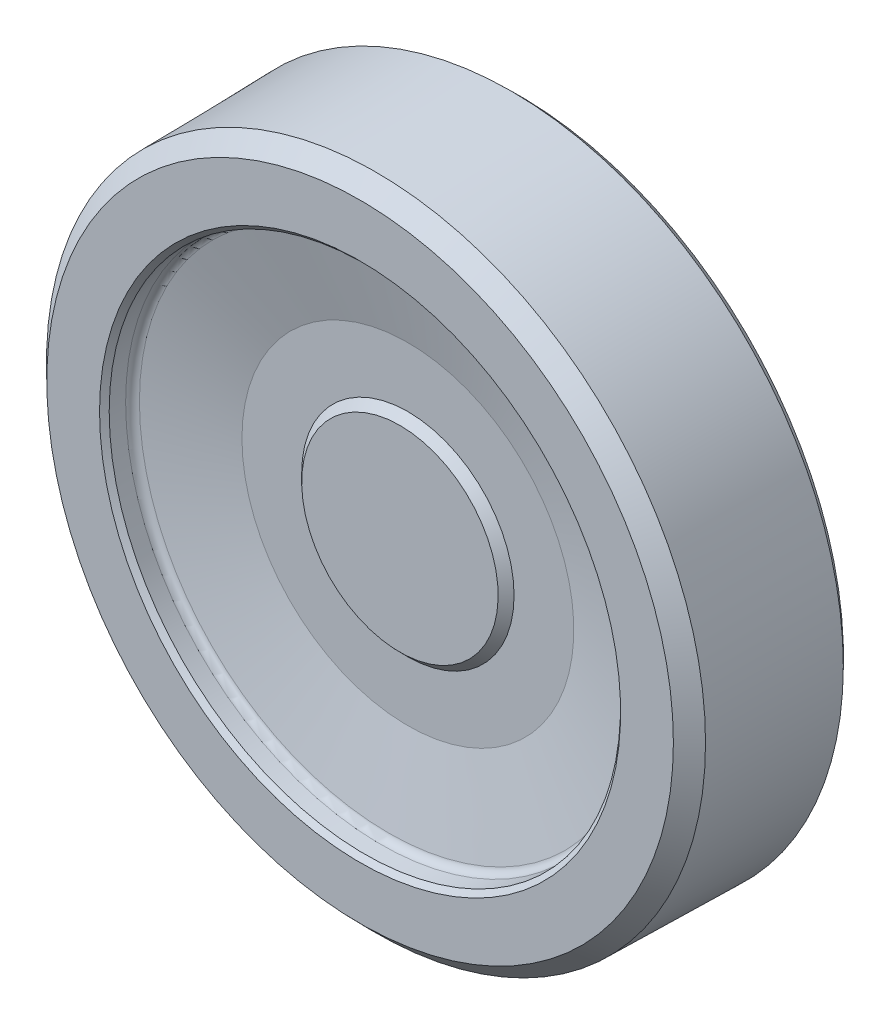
ISO-10303-21;
HEADER;
FILE_DESCRIPTION(('STEP AP214'),'2;1');
FILE_NAME('part.step','',(''),(''),'','','');
FILE_SCHEMA(('AUTOMOTIVE_DESIGN { 1 0 10303 214 1 1 1 1 }'));
ENDSEC;
DATA;
#1=APPLICATION_CONTEXT('core data for automotive mechanical design processes');
#2=APPLICATION_PROTOCOL_DEFINITION('international standard','automotive_design',2000,#1);
#3=PRODUCT_CONTEXT('',#1,'mechanical');
#4=PRODUCT('Part','Part','',(#3));
#5=PRODUCT_RELATED_PRODUCT_CATEGORY('part','',(#4));
#6=PRODUCT_DEFINITION_FORMATION('','',#4);
#7=PRODUCT_DEFINITION_CONTEXT('part definition',#1,'design');
#8=PRODUCT_DEFINITION('design','',#6,#7);
#9=PRODUCT_DEFINITION_SHAPE('','',#8);
#10=(LENGTH_UNIT() NAMED_UNIT(*) SI_UNIT(.MILLI.,.METRE.));
#11=(NAMED_UNIT(*) PLANE_ANGLE_UNIT() SI_UNIT($,.RADIAN.));
#12=(NAMED_UNIT(*) SI_UNIT($,.STERADIAN.) SOLID_ANGLE_UNIT());
#13=UNCERTAINTY_MEASURE_WITH_UNIT(LENGTH_MEASURE(1.E-05),#10,'distance_accuracy_value','');
#14=(GEOMETRIC_REPRESENTATION_CONTEXT(3) GLOBAL_UNCERTAINTY_ASSIGNED_CONTEXT((#13)) GLOBAL_UNIT_ASSIGNED_CONTEXT((#10,
#11,#12)) REPRESENTATION_CONTEXT('',''));
#15=CARTESIAN_POINT('',(0.,0.,0.));
#16=DIRECTION('',(0.,0.,1.));
#17=DIRECTION('',(1.,0.,0.));
#18=AXIS2_PLACEMENT_3D('',#15,#16,#17);
#19=CARTESIAN_POINT('',(7.55,0.,0.));
#20=DIRECTION('',(0.,0.,1.));
#21=DIRECTION('',(-1.,0.,0.));
#22=AXIS2_PLACEMENT_3D('',#19,#20,#21);
#23=PLANE('',#22);
#24=CARTESIAN_POINT('',(0.,0.,0.));
#25=DIRECTION('',(0.,0.,1.));
#26=DIRECTION('',(-1.,0.,0.));
#27=AXIS2_PLACEMENT_3D('',#24,#25,#26);
#28=CIRCLE('',#27,7.55);
#29=CARTESIAN_POINT('',(-7.55,0.,0.));
#30=VERTEX_POINT('',#29);
#31=EDGE_CURVE('E15',#30,#30,#28,.T.);
#32=ORIENTED_EDGE('',*,*,#31,.F.);
#33=EDGE_LOOP('',(#32));
#34=FACE_BOUND('',#33,.T.);
#35=ADVANCED_FACE('F12',(#34),#23,.F.);
#36=CARTESIAN_POINT('',(0.,0.,0.45));
#37=DIRECTION('',(0.,0.,1.));
#38=DIRECTION('',(-1.,0.,0.));
#39=AXIS2_PLACEMENT_3D('',#36,#37,#38);
#40=CONICAL_SURFACE('',#39,8.,0.785398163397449);
#41=CARTESIAN_POINT('',(0.,0.,0.45));
#42=DIRECTION('',(0.,0.,1.));
#43=DIRECTION('',(-1.,0.,0.));
#44=AXIS2_PLACEMENT_3D('',#41,#42,#43);
#45=CIRCLE('',#44,8.);
#46=CARTESIAN_POINT('',(-8.,0.,0.45));
#47=VERTEX_POINT('',#46);
#48=EDGE_CURVE('E186',#47,#47,#45,.T.);
#49=ORIENTED_EDGE('',*,*,#48,.F.);
#50=EDGE_LOOP('',(#49));
#51=FACE_BOUND('',#50,.T.);
#52=ORIENTED_EDGE('',*,*,#31,.T.);
#53=EDGE_LOOP('',(#52));
#54=FACE_BOUND('',#53,.T.);
#55=ADVANCED_FACE('F112',(#51,#54),#40,.T.);
#56=CARTESIAN_POINT('',(0.,0.,0.));
#57=DIRECTION('',(0.,0.,1.));
#58=DIRECTION('',(-1.,0.,0.));
#59=AXIS2_PLACEMENT_3D('',#56,#57,#58);
#60=CYLINDRICAL_SURFACE('',#59,8.);
#61=CARTESIAN_POINT('',(0.,0.,9.));
#62=DIRECTION('',(0.,0.,1.));
#63=DIRECTION('',(-1.,0.,0.));
#64=AXIS2_PLACEMENT_3D('',#61,#62,#63);
#65=CIRCLE('',#64,8.);
#66=CARTESIAN_POINT('',(-8.,0.,9.));
#67=VERTEX_POINT('',#66);
#68=EDGE_CURVE('E184',#67,#67,#65,.F.);
#69=ORIENTED_EDGE('',*,*,#68,.T.);
#70=EDGE_LOOP('',(#69));
#71=FACE_BOUND('',#70,.T.);
#72=ORIENTED_EDGE('',*,*,#48,.T.);
#73=EDGE_LOOP('',(#72));
#74=FACE_BOUND('',#73,.T.);
#75=ADVANCED_FACE('F109',(#71,#74),#60,.T.);
#76=CARTESIAN_POINT('',(0.,0.,19.));
#77=DIRECTION('',(0.,0.,-1.));
#78=DIRECTION('',(1.,0.,0.));
#79=AXIS2_PLACEMENT_3D('',#76,#77,#78);
#80=PLANE('',#79);
#81=CARTESIAN_POINT('',(0.,0.,19.));
#82=DIRECTION('',(0.,0.,-1.));
#83=DIRECTION('',(0.,1.,0.));
#84=AXIS2_PLACEMENT_3D('',#81,#82,#83);
#85=CIRCLE('',#84,7.4);
#86=CARTESIAN_POINT('',(0.,7.4,19.));
#87=VERTEX_POINT('',#86);
#88=EDGE_CURVE('E179',#87,#87,#85,.T.);
#89=ORIENTED_EDGE('',*,*,#88,.F.);
#90=EDGE_LOOP('',(#89));
#91=FACE_BOUND('',#90,.T.);
#92=ADVANCED_FACE('F105',(#91),#80,.F.);
#93=CARTESIAN_POINT('',(13.,0.,9.));
#94=DIRECTION('',(0.,0.,1.));
#95=DIRECTION('',(-1.,0.,0.));
#96=AXIS2_PLACEMENT_3D('',#93,#94,#95);
#97=PLANE('',#96);
#98=CARTESIAN_POINT('',(0.,0.,9.));
#99=DIRECTION('',(0.,0.,1.));
#100=DIRECTION('',(-1.,0.,0.));
#101=AXIS2_PLACEMENT_3D('',#98,#99,#100);
#102=CIRCLE('',#101,13.);
#103=CARTESIAN_POINT('',(-13.,0.,9.));
#104=VERTEX_POINT('',#103);
#105=EDGE_CURVE('E174',#104,#104,#102,.F.);
#106=ORIENTED_EDGE('',*,*,#105,.T.);
#107=EDGE_LOOP('',(#106));
#108=FACE_BOUND('',#107,.T.);
#109=ORIENTED_EDGE('',*,*,#68,.F.);
#110=EDGE_LOOP('',(#109));
#111=FACE_BOUND('',#110,.T.);
#112=ADVANCED_FACE('F101',(#108,#111),#97,.F.);
#113=CARTESIAN_POINT('',(0.,0.,18.4));
#114=DIRECTION('',(0.,0.,-1.));
#115=DIRECTION('',(0.,1.,0.));
#116=AXIS2_PLACEMENT_3D('',#113,#114,#115);
#117=CONICAL_SURFACE('',#116,8.,0.78539816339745);
#118=ORIENTED_EDGE('',*,*,#88,.T.);
#119=EDGE_LOOP('',(#118));
#120=FACE_BOUND('',#119,.T.);
#121=CARTESIAN_POINT('',(0.,0.,18.4));
#122=DIRECTION('',(0.,0.,-1.));
#123=DIRECTION('',(0.,1.,0.));
#124=AXIS2_PLACEMENT_3D('',#121,#122,#123);
#125=CIRCLE('',#124,8.);
#126=CARTESIAN_POINT('',(0.,8.,18.4));
#127=VERTEX_POINT('',#126);
#128=EDGE_CURVE('E170',#127,#127,#125,.F.);
#129=ORIENTED_EDGE('',*,*,#128,.T.);
#130=EDGE_LOOP('',(#129));
#131=FACE_BOUND('',#130,.T.);
#132=ADVANCED_FACE('F97',(#120,#131),#117,.T.);
#133=CARTESIAN_POINT('',(0.,0.,0.));
#134=DIRECTION('',(0.,0.,1.));
#135=DIRECTION('',(-1.,0.,0.));
#136=AXIS2_PLACEMENT_3D('',#133,#134,#135);
#137=CYLINDRICAL_SURFACE('',#136,13.);
#138=CARTESIAN_POINT('',(0.,0.,8.97526975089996));
#139=DIRECTION('',(0.,0.,-1.));
#140=DIRECTION('',(1.,0.,0.));
#141=AXIS2_PLACEMENT_3D('',#138,#139,#140);
#142=CIRCLE('',#141,13.);
#143=CARTESIAN_POINT('',(13.,0.,8.97526975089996));
#144=VERTEX_POINT('',#143);
#145=EDGE_CURVE('E82',#144,#144,#142,.T.);
#146=ORIENTED_EDGE('',*,*,#145,.T.);
#147=EDGE_LOOP('',(#146));
#148=FACE_BOUND('',#147,.T.);
#149=ORIENTED_EDGE('',*,*,#105,.F.);
#150=EDGE_LOOP('',(#149));
#151=FACE_BOUND('',#150,.T.);
#152=ADVANCED_FACE('F93',(#148,#151),#137,.F.);
#153=CARTESIAN_POINT('',(8.,0.,18.4));
#154=DIRECTION('',(0.,0.,-1.));
#155=DIRECTION('',(1.,0.,0.));
#156=AXIS2_PLACEMENT_3D('',#153,#154,#155);
#157=PLANE('',#156);
#158=ORIENTED_EDGE('',*,*,#128,.F.);
#159=EDGE_LOOP('',(#158));
#160=FACE_BOUND('',#159,.T.);
#161=CARTESIAN_POINT('',(0.,0.,18.4));
#162=DIRECTION('',(0.,0.,1.));
#163=DIRECTION('',(-1.,0.,0.));
#164=AXIS2_PLACEMENT_3D('',#161,#162,#163);
#165=CIRCLE('',#164,12.5);
#166=CARTESIAN_POINT('',(-12.5,0.,18.4));
#167=VERTEX_POINT('',#166);
#168=EDGE_CURVE('E77',#167,#167,#165,.T.);
#169=ORIENTED_EDGE('',*,*,#168,.T.);
#170=EDGE_LOOP('',(#169));
#171=FACE_BOUND('',#170,.T.);
#172=ADVANCED_FACE('F89',(#160,#171),#157,.F.);
#173=CARTESIAN_POINT('',(0.,0.,8.97526975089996));
#174=DIRECTION('',(0.,0.,-1.));
#175=DIRECTION('',(1.,0.,0.));
#176=AXIS2_PLACEMENT_3D('',#173,#174,#175);
#177=TOROIDAL_SURFACE('',#176,14.2,1.2);
#178=CARTESIAN_POINT('',(0.,0.,10.102900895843));
#179=DIRECTION('',(0.,0.,1.));
#180=DIRECTION('',(-1.,0.,0.));
#181=AXIS2_PLACEMENT_3D('',#178,#179,#180);
#182=CIRCLE('',#181,13.7895758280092);
#183=CARTESIAN_POINT('',(-13.7895758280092,0.,10.102900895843));
#184=VERTEX_POINT('',#183);
#185=EDGE_CURVE('E72',#184,#184,#182,.T.);
#186=ORIENTED_EDGE('',*,*,#185,.F.);
#187=EDGE_LOOP('',(#186));
#188=FACE_BOUND('',#187,.T.);
#189=ORIENTED_EDGE('',*,*,#145,.F.);
#190=EDGE_LOOP('',(#189));
#191=FACE_BOUND('',#190,.T.);
#192=ADVANCED_FACE('F85',(#188,#191),#177,.F.);
#193=CARTESIAN_POINT('',(0.,0.,19.8484699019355));
#194=DIRECTION('',(0.,0.,1.));
#195=DIRECTION('',(-1.,0.,0.));
#196=AXIS2_PLACEMENT_3D('',#193,#194,#195);
#197=CONICAL_SURFACE('',#196,18.7740124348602,1.34390352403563);
#198=ORIENTED_EDGE('',*,*,#168,.F.);
#199=EDGE_LOOP('',(#198));
#200=FACE_BOUND('',#199,.T.);
#201=CARTESIAN_POINT('',(0.,0.,19.8484699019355));
#202=DIRECTION('',(0.,0.,-1.));
#203=DIRECTION('',(1.,0.,0.));
#204=AXIS2_PLACEMENT_3D('',#201,#202,#203);
#205=CIRCLE('',#204,18.7740124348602);
#206=CARTESIAN_POINT('',(18.7740124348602,0.,19.8484699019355));
#207=VERTEX_POINT('',#206);
#208=EDGE_CURVE('E69',#207,#207,#205,.F.);
#209=ORIENTED_EDGE('',*,*,#208,.T.);
#210=EDGE_LOOP('',(#209));
#211=FACE_BOUND('',#210,.T.);
#212=ADVANCED_FACE('F88',(#200,#211),#197,.F.);
#213=CARTESIAN_POINT('',(0.,0.,11.7902601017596));
#214=DIRECTION('',(0.,0.,1.));
#215=DIRECTION('',(-1.,0.,0.));
#216=AXIS2_PLACEMENT_3D('',#213,#214,#215);
#217=CONICAL_SURFACE('',#216,18.4255571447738,1.22173047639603);
#218=CARTESIAN_POINT('',(0.,0.,11.7902601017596));
#219=DIRECTION('',(0.,0.,-1.));
#220=DIRECTION('',(1.,0.,0.));
#221=AXIS2_PLACEMENT_3D('',#218,#219,#220);
#222=CIRCLE('',#221,18.4255571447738);
#223=CARTESIAN_POINT('',(18.4255571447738,0.,11.7902601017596));
#224=VERTEX_POINT('',#223);
#225=EDGE_CURVE('E45',#224,#224,#222,.T.);
#226=ORIENTED_EDGE('',*,*,#225,.T.);
#227=EDGE_LOOP('',(#226));
#228=FACE_BOUND('',#227,.T.);
#229=ORIENTED_EDGE('',*,*,#185,.T.);
#230=EDGE_LOOP('',(#229));
#231=FACE_BOUND('',#230,.T.);
#232=ADVANCED_FACE('F63',(#228,#231),#217,.T.);
#233=CARTESIAN_POINT('',(0.,0.,20.4330919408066));
#234=DIRECTION('',(0.,0.,-1.));
#235=DIRECTION('',(1.,0.,0.));
#236=AXIS2_PLACEMENT_3D('',#233,#234,#235);
#237=TOROIDAL_SURFACE('',#236,18.6390418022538,0.6);
#238=ORIENTED_EDGE('',*,*,#208,.F.);
#239=EDGE_LOOP('',(#238));
#240=FACE_BOUND('',#239,.T.);
#241=CARTESIAN_POINT('',(0.,0.,20.4226204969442));
#242=DIRECTION('',(0.,0.,1.));
#243=DIRECTION('',(-1.,0.,0.));
#244=AXIS2_PLACEMENT_3D('',#241,#242,#243);
#245=CIRCLE('',#244,19.2389504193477);
#246=CARTESIAN_POINT('',(-19.2389504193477,0.,20.4226204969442));
#247=VERTEX_POINT('',#246);
#248=EDGE_CURVE('E40',#247,#247,#245,.T.);
#249=ORIENTED_EDGE('',*,*,#248,.T.);
#250=EDGE_LOOP('',(#249));
#251=FACE_BOUND('',#250,.T.);
#252=ADVANCED_FACE('F57',(#240,#251),#237,.F.);
#253=CARTESIAN_POINT('',(0.,0.,11.2264445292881));
#254=DIRECTION('',(0.,0.,-1.));
#255=DIRECTION('',(1.,0.,0.));
#256=AXIS2_PLACEMENT_3D('',#253,#254,#255);
#257=TOROIDAL_SURFACE('',#256,18.6307692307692,0.6);
#258=CARTESIAN_POINT('',(0.,0.,11.2264445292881));
#259=DIRECTION('',(0.,0.,1.));
#260=DIRECTION('',(-1.,0.,0.));
#261=AXIS2_PLACEMENT_3D('',#258,#259,#260);
#262=CIRCLE('',#261,19.2307692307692);
#263=CARTESIAN_POINT('',(-19.2307692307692,0.,11.2264445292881));
#264=VERTEX_POINT('',#263);
#265=EDGE_CURVE('E35',#264,#264,#262,.F.);
#266=ORIENTED_EDGE('',*,*,#265,.T.);
#267=EDGE_LOOP('',(#266));
#268=FACE_BOUND('',#267,.T.);
#269=ORIENTED_EDGE('',*,*,#225,.F.);
#270=EDGE_LOOP('',(#269));
#271=FACE_BOUND('',#270,.T.);
#272=ADVANCED_FACE('F52',(#268,#271),#257,.F.);
#273=CARTESIAN_POINT('',(0.,0.,21.6400548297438));
#274=DIRECTION('',(0.,0.,1.));
#275=DIRECTION('',(-1.,0.,0.));
#276=AXIS2_PLACEMENT_3D('',#273,#274,#275);
#277=CONICAL_SURFACE('',#276,19.2602008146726,0.017453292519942);
#278=ORIENTED_EDGE('',*,*,#248,.F.);
#279=EDGE_LOOP('',(#278));
#280=FACE_BOUND('',#279,.T.);
#281=CARTESIAN_POINT('',(0.,0.,21.6400548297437));
#282=DIRECTION('',(0.,0.,1.));
#283=DIRECTION('',(-1.,0.,0.));
#284=AXIS2_PLACEMENT_3D('',#281,#282,#283);
#285=CIRCLE('',#284,19.2602008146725);
#286=CARTESIAN_POINT('',(-19.2602008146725,0.,21.6400548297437));
#287=VERTEX_POINT('',#286);
#288=EDGE_CURVE('E31',#287,#287,#285,.T.);
#289=ORIENTED_EDGE('',*,*,#288,.T.);
#290=EDGE_LOOP('',(#289));
#291=FACE_BOUND('',#290,.T.);
#292=ADVANCED_FACE('F56',(#280,#291),#277,.F.);
#293=CARTESIAN_POINT('',(0.,0.,0.));
#294=DIRECTION('',(0.,0.,1.));
#295=DIRECTION('',(-1.,0.,0.));
#296=AXIS2_PLACEMENT_3D('',#293,#294,#295);
#297=CYLINDRICAL_SURFACE('',#296,19.2307692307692);
#298=CARTESIAN_POINT('',(0.,0.,10.));
#299=DIRECTION('',(0.,0.,1.));
#300=DIRECTION('',(-1.,0.,0.));
#301=AXIS2_PLACEMENT_3D('',#298,#299,#300);
#302=CIRCLE('',#301,19.2307692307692);
#303=CARTESIAN_POINT('',(-19.2307692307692,0.,10.));
#304=VERTEX_POINT('',#303);
#305=EDGE_CURVE('E34',#304,#304,#302,.F.);
#306=ORIENTED_EDGE('',*,*,#305,.T.);
#307=EDGE_LOOP('',(#306));
#308=FACE_BOUND('',#307,.T.);
#309=ORIENTED_EDGE('',*,*,#265,.F.);
#310=EDGE_LOOP('',(#309));
#311=FACE_BOUND('',#310,.T.);
#312=ADVANCED_FACE('F148',(#308,#311),#297,.F.);
#313=CARTESIAN_POINT('',(0.,0.,22.));
#314=DIRECTION('',(0.,0.,1.));
#315=DIRECTION('',(-1.,0.,0.));
#316=AXIS2_PLACEMENT_3D('',#313,#314,#315);
#317=CONICAL_SURFACE('',#316,19.6264836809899,0.794124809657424);
#318=ORIENTED_EDGE('',*,*,#288,.F.);
#319=EDGE_LOOP('',(#318));
#320=FACE_BOUND('',#319,.T.);
#321=CARTESIAN_POINT('',(0.,0.,22.));
#322=DIRECTION('',(0.,0.,1.));
#323=DIRECTION('',(-1.,0.,0.));
#324=AXIS2_PLACEMENT_3D('',#321,#322,#323);
#325=CIRCLE('',#324,19.6264836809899);
#326=CARTESIAN_POINT('',(-19.6264836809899,0.,22.));
#327=VERTEX_POINT('',#326);
#328=EDGE_CURVE('E201',#327,#327,#325,.T.);
#329=ORIENTED_EDGE('',*,*,#328,.T.);
#330=EDGE_LOOP('',(#329));
#331=FACE_BOUND('',#330,.T.);
#332=ADVANCED_FACE('F145',(#320,#331),#317,.F.);
#333=CARTESIAN_POINT('',(24.4104730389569,0.,10.));
#334=DIRECTION('',(0.,0.,1.));
#335=DIRECTION('',(-1.,0.,0.));
#336=AXIS2_PLACEMENT_3D('',#333,#334,#335);
#337=PLANE('',#336);
#338=CARTESIAN_POINT('',(0.,0.,10.));
#339=DIRECTION('',(0.,0.,1.));
#340=DIRECTION('',(-1.,0.,0.));
#341=AXIS2_PLACEMENT_3D('',#338,#339,#340);
#342=CIRCLE('',#341,24.4104730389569);
#343=CARTESIAN_POINT('',(-24.4104730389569,0.,10.));
#344=VERTEX_POINT('',#343);
#345=EDGE_CURVE('E198',#344,#344,#342,.T.);
#346=ORIENTED_EDGE('',*,*,#345,.F.);
#347=EDGE_LOOP('',(#346));
#348=FACE_BOUND('',#347,.T.);
#349=ORIENTED_EDGE('',*,*,#305,.F.);
#350=EDGE_LOOP('',(#349));
#351=FACE_BOUND('',#350,.T.);
#352=ADVANCED_FACE('F141',(#348,#351),#337,.F.);
#353=CARTESIAN_POINT('',(19.6264836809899,0.,22.));
#354=DIRECTION('',(0.,0.,-1.));
#355=DIRECTION('',(1.,0.,0.));
#356=AXIS2_PLACEMENT_3D('',#353,#354,#355);
#357=PLANE('',#356);
#358=ORIENTED_EDGE('',*,*,#328,.F.);
#359=EDGE_LOOP('',(#358));
#360=FACE_BOUND('',#359,.T.);
#361=CARTESIAN_POINT('',(0.,0.,22.));
#362=DIRECTION('',(0.,0.,-1.));
#363=DIRECTION('',(1.,0.,0.));
#364=AXIS2_PLACEMENT_3D('',#361,#362,#363);
#365=CIRCLE('',#364,23.6010122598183);
#366=CARTESIAN_POINT('',(23.6010122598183,0.,22.));
#367=VERTEX_POINT('',#366);
#368=EDGE_CURVE('E24',#367,#367,#365,.T.);
#369=ORIENTED_EDGE('',*,*,#368,.F.);
#370=EDGE_LOOP('',(#369));
#371=FACE_BOUND('',#370,.T.);
#372=ADVANCED_FACE('F137',(#360,#371),#357,.F.);
#373=CARTESIAN_POINT('',(0.,0.,10.5999086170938));
#374=DIRECTION('',(0.,0.,1.));
#375=DIRECTION('',(-1.,0.,0.));
#376=AXIS2_PLACEMENT_3D('',#373,#374,#375);
#377=CONICAL_SURFACE('',#376,25.0000015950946,0.776671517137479);
#378=CARTESIAN_POINT('',(0.,0.,10.5999086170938));
#379=DIRECTION('',(0.,0.,-1.));
#380=DIRECTION('',(1.,0.,0.));
#381=AXIS2_PLACEMENT_3D('',#378,#379,#380);
#382=CIRCLE('',#381,25.0000015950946);
#383=CARTESIAN_POINT('',(25.0000015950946,0.,10.5999086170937));
#384=VERTEX_POINT('',#383);
#385=EDGE_CURVE('E19',#384,#384,#382,.F.);
#386=ORIENTED_EDGE('',*,*,#385,.F.);
#387=EDGE_LOOP('',(#386));
#388=FACE_BOUND('',#387,.T.);
#389=ORIENTED_EDGE('',*,*,#345,.T.);
#390=EDGE_LOOP('',(#389));
#391=FACE_BOUND('',#390,.T.);
#392=ADVANCED_FACE('F130',(#388,#391),#377,.T.);
#393=CARTESIAN_POINT('',(0.,0.,20.8001827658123));
#394=DIRECTION('',(0.,0.,-1.));
#395=DIRECTION('',(1.,0.,0.));
#396=AXIS2_PLACEMENT_3D('',#393,#394,#395);
#397=CONICAL_SURFACE('',#396,24.8219551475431,0.79412480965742);
#398=ORIENTED_EDGE('',*,*,#368,.T.);
#399=EDGE_LOOP('',(#398));
#400=FACE_BOUND('',#399,.T.);
#401=CARTESIAN_POINT('',(0.,0.,20.8001827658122));
#402=DIRECTION('',(0.,0.,-1.));
#403=DIRECTION('',(1.,0.,0.));
#404=AXIS2_PLACEMENT_3D('',#401,#402,#403);
#405=CIRCLE('',#404,24.8219551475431);
#406=CARTESIAN_POINT('',(24.8219551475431,0.,20.8001827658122));
#407=VERTEX_POINT('',#406);
#408=EDGE_CURVE('E8',#407,#407,#405,.T.);
#409=ORIENTED_EDGE('',*,*,#408,.F.);
#410=EDGE_LOOP('',(#409));
#411=FACE_BOUND('',#410,.T.);
#412=ADVANCED_FACE('F125',(#400,#411),#397,.T.);
#413=CARTESIAN_POINT('',(0.,0.,10.5999086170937));
#414=DIRECTION('',(0.,0.,-1.));
#415=DIRECTION('',(1.,0.,0.));
#416=AXIS2_PLACEMENT_3D('',#413,#414,#415);
#417=CONICAL_SURFACE('',#416,25.0000015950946,0.0174532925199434);
#418=ORIENTED_EDGE('',*,*,#408,.T.);
#419=EDGE_LOOP('',(#418));
#420=FACE_BOUND('',#419,.T.);
#421=ORIENTED_EDGE('',*,*,#385,.T.);
#422=EDGE_LOOP('',(#421));
#423=FACE_BOUND('',#422,.T.);
#424=ADVANCED_FACE('F123',(#420,#423),#417,.T.);
#425=CLOSED_SHELL('',(#35,#55,#75,#92,#112,#132,#152,#172,#192,#212,#232,#252,#272,#292,#312,
#332,#352,#372,#392,#412,#424));
#426=MANIFOLD_SOLID_BREP('B1',#425);
#427=ADVANCED_BREP_SHAPE_REPRESENTATION('',(#18,#426),#14);
#428=SHAPE_DEFINITION_REPRESENTATION(#9,#427);
ENDSEC;
END-ISO-10303-21;
